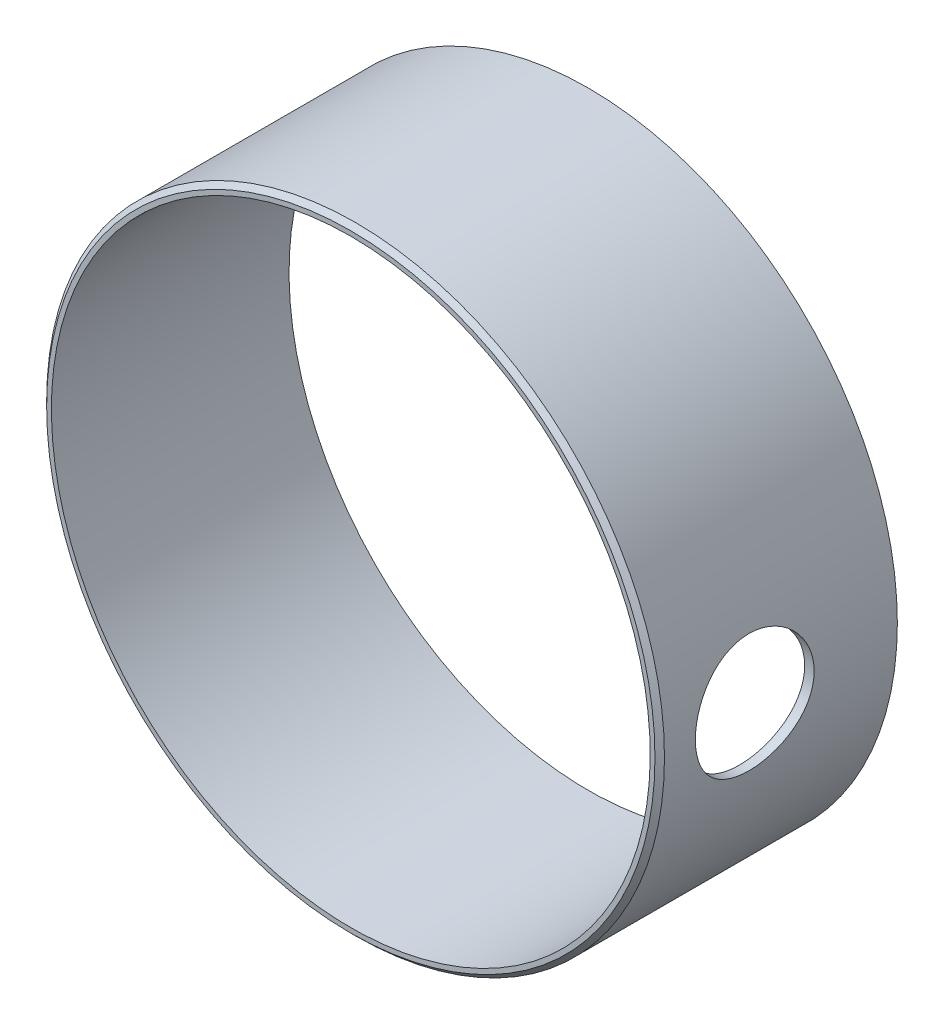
ISO-10303-21;
HEADER;
FILE_DESCRIPTION(('STEP AP214'),'2;1');
FILE_NAME('part.step','',(''),(''),'','','');
FILE_SCHEMA(('AUTOMOTIVE_DESIGN { 1 0 10303 214 1 1 1 1 }'));
ENDSEC;
DATA;
#1=APPLICATION_CONTEXT('core data for automotive mechanical design processes');
#2=APPLICATION_PROTOCOL_DEFINITION('international standard','automotive_design',2000,#1);
#3=PRODUCT_CONTEXT('',#1,'mechanical');
#4=PRODUCT('Part','Part','',(#3));
#5=PRODUCT_RELATED_PRODUCT_CATEGORY('part','',(#4));
#6=PRODUCT_DEFINITION_FORMATION('','',#4);
#7=PRODUCT_DEFINITION_CONTEXT('part definition',#1,'design');
#8=PRODUCT_DEFINITION('design','',#6,#7);
#9=PRODUCT_DEFINITION_SHAPE('','',#8);
#10=(LENGTH_UNIT() NAMED_UNIT(*) SI_UNIT(.MILLI.,.METRE.));
#11=(NAMED_UNIT(*) PLANE_ANGLE_UNIT() SI_UNIT($,.RADIAN.));
#12=(NAMED_UNIT(*) SI_UNIT($,.STERADIAN.) SOLID_ANGLE_UNIT());
#13=UNCERTAINTY_MEASURE_WITH_UNIT(LENGTH_MEASURE(1.E-05),#10,'distance_accuracy_value','');
#14=(GEOMETRIC_REPRESENTATION_CONTEXT(3) GLOBAL_UNCERTAINTY_ASSIGNED_CONTEXT((#13)) GLOBAL_UNIT_ASSIGNED_CONTEXT((#10,
#11,#12)) REPRESENTATION_CONTEXT('',''));
#15=CARTESIAN_POINT('',(0.,0.,0.));
#16=DIRECTION('',(0.,0.,1.));
#17=DIRECTION('',(1.,0.,0.));
#18=AXIS2_PLACEMENT_3D('',#15,#16,#17);
#19=CARTESIAN_POINT('',(0.,0.,0.));
#20=DIRECTION('',(0.,0.,-1.));
#21=DIRECTION('',(0.,1.,0.));
#22=AXIS2_PLACEMENT_3D('',#19,#20,#21);
#23=CYLINDRICAL_SURFACE('',#22,31.5);
#24=CARTESIAN_POINT('',(30.8737347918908,6.25,15.));
#25=CARTESIAN_POINT('',(30.8737329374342,6.25000343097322,14.8262727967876));
#26=CARTESIAN_POINT('',(30.8752038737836,6.24275461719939,14.6525886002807));
#27=CARTESIAN_POINT('',(30.8810399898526,6.21382371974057,14.3064233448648));
#28=CARTESIAN_POINT('',(30.8854056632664,6.19213917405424,14.133942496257));
#29=CARTESIAN_POINT('',(30.8969076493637,6.13448898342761,13.7913916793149));
#30=CARTESIAN_POINT('',(30.9040454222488,6.09851581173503,13.621323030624));
#31=CARTESIAN_POINT('',(30.920884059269,6.01255741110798,13.2848273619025));
#32=CARTESIAN_POINT('',(30.9305858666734,5.96256702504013,13.1184017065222));
#33=CARTESIAN_POINT('',(30.9522540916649,5.84904246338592,12.7906471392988));
#34=CARTESIAN_POINT('',(30.9642173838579,5.78552696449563,12.6293115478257));
#35=CARTESIAN_POINT('',(30.9900789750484,5.64535938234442,12.3125428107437));
#36=CARTESIAN_POINT('',(31.0039779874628,5.56870245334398,12.1571118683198));
#37=CARTESIAN_POINT('',(31.0333077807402,5.40285962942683,11.8533284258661));
#38=CARTESIAN_POINT('',(31.0487378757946,5.31367933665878,11.7049728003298));
#39=CARTESIAN_POINT('',(31.0807103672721,5.12335381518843,11.4161945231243));
#40=CARTESIAN_POINT('',(31.0972531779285,5.02220411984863,11.2757748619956));
#41=CARTESIAN_POINT('',(31.1311941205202,4.80736089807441,11.0022010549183));
#42=CARTESIAN_POINT('',(31.1486001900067,4.69353017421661,10.8691556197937));
#43=CARTESIAN_POINT('',(31.1835977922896,4.45508145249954,10.6130450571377));
#44=CARTESIAN_POINT('',(31.2011893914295,4.33045947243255,10.4899836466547));
#45=CARTESIAN_POINT('',(31.2360566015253,4.07134467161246,10.2547644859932));
#46=CARTESIAN_POINT('',(31.2533323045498,3.93685478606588,10.1426035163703));
#47=CARTESIAN_POINT('',(31.287099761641,3.65882536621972,9.92987700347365));
#48=CARTESIAN_POINT('',(31.3035912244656,3.5152825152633,9.82931574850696));
#49=CARTESIAN_POINT('',(31.3354557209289,3.21894343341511,9.63976772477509));
#50=CARTESIAN_POINT('',(31.35081843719,3.06608079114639,9.55088298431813));
#51=CARTESIAN_POINT('',(31.3798443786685,2.75319259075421,9.3862938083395));
#52=CARTESIAN_POINT('',(31.3935069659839,2.59316437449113,9.31059431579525));
#53=CARTESIAN_POINT('',(31.4187299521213,2.26717444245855,9.17302141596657));
#54=CARTESIAN_POINT('',(31.4302912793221,2.10121538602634,9.11114189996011));
#55=CARTESIAN_POINT('',(31.4509947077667,1.7645151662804,9.00163271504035));
#56=CARTESIAN_POINT('',(31.4601359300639,1.59377229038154,8.95400822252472));
#57=CARTESIAN_POINT('',(31.4832888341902,1.08068516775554,8.83425214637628));
#58=CARTESIAN_POINT('',(31.4933997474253,0.732839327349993,8.78328595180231));
#59=CARTESIAN_POINT('',(31.4997983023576,0.208828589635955,8.75102221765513));
#60=CARTESIAN_POINT('',(31.5004683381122,0.0337130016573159,8.74763952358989));
#61=CARTESIAN_POINT('',(31.4988983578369,-0.316194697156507,8.75555272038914));
#62=CARTESIAN_POINT('',(31.4966582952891,-0.490986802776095,8.76684884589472));
#63=CARTESIAN_POINT('',(31.4857296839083,-1.00796703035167,8.82219674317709));
#64=CARTESIAN_POINT('',(31.472893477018,-1.34804279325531,8.88739452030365));
#65=CARTESIAN_POINT('',(31.4374323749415,-2.01215083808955,9.07270935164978));
#66=CARTESIAN_POINT('',(31.4148070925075,-2.33618248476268,9.19282857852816));
#67=CARTESIAN_POINT('',(31.3620508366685,-2.96156349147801,9.48533891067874));
#68=CARTESIAN_POINT('',(31.3318740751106,-3.26275931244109,9.65805034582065));
#69=CARTESIAN_POINT('',(31.267341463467,-3.83218353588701,10.0506044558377));
#70=CARTESIAN_POINT('',(31.2329851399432,-4.10040819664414,10.2704524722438));
#71=CARTESIAN_POINT('',(31.1631945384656,-4.60113096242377,10.7555155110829));
#72=CARTESIAN_POINT('',(31.1277518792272,-4.83293716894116,11.0214441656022));
#73=CARTESIAN_POINT('',(31.060342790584,-5.24877307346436,11.5887575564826));
#74=CARTESIAN_POINT('',(31.0283764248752,-5.43280189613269,11.8901429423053));
#75=CARTESIAN_POINT('',(30.9715233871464,-5.74809359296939,12.5207984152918));
#76=CARTESIAN_POINT('',(30.9466515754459,-5.87924594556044,12.8501251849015));
#77=CARTESIAN_POINT('',(30.9070229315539,-6.08415448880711,13.5267477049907));
#78=CARTESIAN_POINT('',(30.8922648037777,-6.15791803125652,13.8740411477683));
#79=CARTESIAN_POINT('',(30.8747936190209,-6.24492412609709,14.5704712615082));
#80=CARTESIAN_POINT('',(30.8718818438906,-6.25916525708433,14.9194783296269));
#81=CARTESIAN_POINT('',(30.8778998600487,-6.22940790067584,15.6148815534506));
#82=CARTESIAN_POINT('',(30.8868289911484,-6.1854126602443,15.9612778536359));
#83=CARTESIAN_POINT('',(30.9153367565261,-6.0412921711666,16.6382796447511));
#84=CARTESIAN_POINT('',(30.9348143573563,-5.94169916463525,16.9690030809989));
#85=CARTESIAN_POINT('',(30.9821360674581,-5.68977753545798,17.6090696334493));
#86=CARTESIAN_POINT('',(31.0099808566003,-5.53744462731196,17.9184110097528));
#87=CARTESIAN_POINT('',(31.0713466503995,-5.18210654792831,18.511304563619));
#88=CARTESIAN_POINT('',(31.1049359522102,-4.97847581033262,18.7944745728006));
#89=CARTESIAN_POINT('',(31.1738185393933,-4.52714037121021,19.3229918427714));
#90=CARTESIAN_POINT('',(31.2091119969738,-4.27943120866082,19.5683352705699));
#91=CARTESIAN_POINT('',(31.2780686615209,-3.74255534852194,20.0179967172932));
#92=CARTESIAN_POINT('',(31.3116992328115,-3.45281947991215,20.2216398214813));
#93=CARTESIAN_POINT('',(31.3729823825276,-2.84247168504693,20.5774022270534));
#94=CARTESIAN_POINT('',(31.4006352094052,-2.52186104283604,20.7295236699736));
#95=CARTESIAN_POINT('',(31.4352174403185,-2.02598824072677,20.9151464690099));
#96=CARTESIAN_POINT('',(31.4455792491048,-1.85860970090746,20.9698495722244));
#97=CARTESIAN_POINT('',(31.463775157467,-1.51972246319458,21.0649695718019));
#98=CARTESIAN_POINT('',(31.471610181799,-1.34821530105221,21.1053916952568));
#99=CARTESIAN_POINT('',(31.4845261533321,-1.00229480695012,21.1716235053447));
#100=CARTESIAN_POINT('',(31.4896068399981,-0.827881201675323,21.1974318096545));
#101=CARTESIAN_POINT('',(31.4968690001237,-0.4774391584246,21.2342269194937));
#102=CARTESIAN_POINT('',(31.4990505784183,-0.301410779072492,21.2452142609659));
#103=CARTESIAN_POINT('',(31.500439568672,0.0479346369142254,21.2522158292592));
#104=CARTESIAN_POINT('',(31.4996972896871,0.221246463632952,21.2484833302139));
#105=CARTESIAN_POINT('',(31.4953722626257,0.566923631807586,21.2266434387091));
#106=CARTESIAN_POINT('',(31.4917895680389,0.739288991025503,21.2085363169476));
#107=CARTESIAN_POINT('',(31.4818824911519,1.08187200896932,21.1580870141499));
#108=CARTESIAN_POINT('',(31.4755576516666,1.2520893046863,21.1257424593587));
#109=CARTESIAN_POINT('',(31.4603441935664,1.5890828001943,21.0470855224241));
#110=CARTESIAN_POINT('',(31.4514564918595,1.75586020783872,21.0007781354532));
#111=CARTESIAN_POINT('',(31.4313799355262,2.08456723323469,20.8946460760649));
#112=CARTESIAN_POINT('',(31.4201954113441,2.24650532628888,20.8348468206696));
#113=CARTESIAN_POINT('',(31.3958242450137,2.56469769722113,20.7021512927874));
#114=CARTESIAN_POINT('',(31.3826383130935,2.72095396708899,20.6292596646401));
#115=CARTESIAN_POINT('',(31.3546124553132,3.02686005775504,20.4708589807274));
#116=CARTESIAN_POINT('',(31.339771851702,3.17650713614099,20.3853447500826));
#117=CARTESIAN_POINT('',(31.3088462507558,3.4680884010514,20.2023533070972));
#118=CARTESIAN_POINT('',(31.2927616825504,3.61002521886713,20.1048802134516));
#119=CARTESIAN_POINT('',(31.2595064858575,3.88755786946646,19.8969324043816));
#120=CARTESIAN_POINT('',(31.2423224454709,4.02301297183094,19.7862719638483));
#121=CARTESIAN_POINT('',(31.2075919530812,4.28410395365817,19.5540603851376));
#122=CARTESIAN_POINT('',(31.1900456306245,4.40974326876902,19.4325130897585));
#123=CARTESIAN_POINT('',(31.1550607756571,4.6504833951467,19.1792400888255));
#124=CARTESIAN_POINT('',(31.1376223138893,4.76557785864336,19.0475083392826));
#125=CARTESIAN_POINT('',(31.1033572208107,4.98431786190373,18.7748655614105));
#126=CARTESIAN_POINT('',(31.0865303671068,5.08796759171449,18.6339579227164));
#127=CARTESIAN_POINT('',(31.0537767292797,5.28421806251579,18.3422708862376));
#128=CARTESIAN_POINT('',(31.0378618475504,5.37668508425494,18.1914001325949));
#129=CARTESIAN_POINT('',(31.0076039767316,5.54852295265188,17.8822996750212));
#130=CARTESIAN_POINT('',(30.993260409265,5.62789862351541,17.7240727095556));
#131=CARTESIAN_POINT('',(30.9665697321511,5.77295436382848,17.4014078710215));
#132=CARTESIAN_POINT('',(30.9542213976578,5.83864284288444,17.2369738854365));
#133=CARTESIAN_POINT('',(30.9318811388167,5.95586065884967,16.9030366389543));
#134=CARTESIAN_POINT('',(30.9218887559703,6.00739275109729,16.7335343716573));
#135=CARTESIAN_POINT('',(30.9003663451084,6.11734689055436,16.3075185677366));
#136=CARTESIAN_POINT('',(30.890434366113,6.16702408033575,16.0486126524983));
#137=CARTESIAN_POINT('',(30.877120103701,6.23334748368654,15.526438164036));
#138=CARTESIAN_POINT('',(30.8737376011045,6.24999480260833,15.2631697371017));
#139=CARTESIAN_POINT('',(30.8737347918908,6.25,15.));
#140=B_SPLINE_CURVE_WITH_KNOTS('',3,(#24,#25,#26,#27,#28,#29,#30,#31,#32,#33,#34,#35,#36,#37,
#38,#39,#40,#41,#42,#43,#44,#45,#46,#47,#48,#49,#50,#51,#52,#53,#54,#55,#56,#57,#58,#59,#60,#61,
#62,#63,#64,#65,#66,#67,#68,#69,#70,#71,#72,#73,#74,#75,#76,#77,#78,#79,#80,#81,#82,#83,#84,#85,
#86,#87,#88,#89,#90,#91,#92,#93,#94,#95,#96,#97,#98,#99,#100,#101,#102,#103,#104,#105,#106,#107,
#108,#109,#110,#111,#112,#113,#114,#115,#116,#117,#118,#119,#120,#121,#122,#123,#124,#125,#126,
#127,#128,#129,#130,#131,#132,#133,#134,#135,#136,#137,#138,#139),.UNSPECIFIED.,.T.,.F.,(4,2,2,
2,2,2,2,2,2,2,2,2,2,2,2,2,2,2,2,2,2,2,2,2,2,2,2,2,2,2,2,2,2,2,2,2,2,2,2,2,2,2,2,2,2,2,2,2,2,2,2,
2,2,2,2,2,2,4),(0.,0.520950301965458,1.04198947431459,1.56330347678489,2.08480953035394,
2.60560005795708,3.12658303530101,3.64733369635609,4.16827930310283,4.69554003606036,
5.22299617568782,5.75029605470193,6.27779025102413,6.80962408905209,7.34165687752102,
7.87345402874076,8.40544405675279,9.45446135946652,9.97939718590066,10.5043414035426,
11.5385567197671,12.5728129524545,13.6134991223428,14.6543032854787,15.7129641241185,
16.7716443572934,17.8325260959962,18.8932719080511,19.9361488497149,20.978967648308,
22.0119705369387,23.0450573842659,24.0914101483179,25.137868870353,26.2001181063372,
27.2623231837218,27.7909802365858,28.3194435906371,28.8479569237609,29.3764511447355,
29.8958919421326,30.4153229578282,30.9348406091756,31.4541726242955,31.9725343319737,
32.4907125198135,33.0091037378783,33.5273169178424,34.0539609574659,34.5804198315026,
35.107193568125,35.6337738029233,36.1661321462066,36.698293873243,37.2301276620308,
37.7618578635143,38.551043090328,39.3402019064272),.UNSPECIFIED.);
#141=CARTESIAN_POINT('',(30.8737347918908,6.25,15.));
#142=VERTEX_POINT('',#141);
#143=EDGE_CURVE('E48',#142,#142,#140,.T.);
#144=ORIENTED_EDGE('',*,*,#143,.F.);
#145=EDGE_LOOP('',(#144));
#146=FACE_BOUND('',#145,.T.);
#147=CARTESIAN_POINT('',(0.,0.,0.));
#148=DIRECTION('',(0.,0.,-1.));
#149=DIRECTION('',(0.,1.,0.));
#150=AXIS2_PLACEMENT_3D('',#147,#148,#149);
#151=CIRCLE('',#150,31.5);
#152=CARTESIAN_POINT('',(0.,31.5,0.));
#153=VERTEX_POINT('',#152);
#154=EDGE_CURVE('E54',#153,#153,#151,.T.);
#155=ORIENTED_EDGE('',*,*,#154,.T.);
#156=EDGE_LOOP('',(#155));
#157=FACE_BOUND('',#156,.T.);
#158=CARTESIAN_POINT('',(0.,0.,25.));
#159=DIRECTION('',(0.,0.,-1.));
#160=DIRECTION('',(0.,1.,0.));
#161=AXIS2_PLACEMENT_3D('',#158,#159,#160);
#162=CIRCLE('',#161,31.5);
#163=CARTESIAN_POINT('',(0.,31.5,25.));
#164=VERTEX_POINT('',#163);
#165=EDGE_CURVE('E27',#164,#164,#162,.T.);
#166=ORIENTED_EDGE('',*,*,#165,.F.);
#167=EDGE_LOOP('',(#166));
#168=FACE_BOUND('',#167,.T.);
#169=ADVANCED_FACE('F12',(#146,#157,#168),#23,.F.);
#170=CARTESIAN_POINT('',(31.5,0.,25.));
#171=DIRECTION('',(0.,0.,1.));
#172=DIRECTION('',(0.,-1.,0.));
#173=AXIS2_PLACEMENT_3D('',#170,#171,#172);
#174=PLANE('',#173);
#175=CARTESIAN_POINT('',(0.,0.,25.));
#176=DIRECTION('',(0.,0.,1.));
#177=DIRECTION('',(0.,-1.,0.));
#178=AXIS2_PLACEMENT_3D('',#175,#176,#177);
#179=CIRCLE('',#178,32.);
#180=CARTESIAN_POINT('',(0.,-32.,25.));
#181=VERTEX_POINT('',#180);
#182=EDGE_CURVE('E8',#181,#181,#179,.T.);
#183=ORIENTED_EDGE('',*,*,#182,.T.);
#184=EDGE_LOOP('',(#183));
#185=FACE_BOUND('',#184,.T.);
#186=ORIENTED_EDGE('',*,*,#165,.T.);
#187=EDGE_LOOP('',(#186));
#188=FACE_BOUND('',#187,.T.);
#189=ADVANCED_FACE('F63',(#185,#188),#174,.T.);
#190=CARTESIAN_POINT('',(0.,0.,0.));
#191=DIRECTION('',(0.,0.,-1.));
#192=DIRECTION('',(0.,1.,0.));
#193=AXIS2_PLACEMENT_3D('',#190,#191,#192);
#194=CYLINDRICAL_SURFACE('',#193,32.5);
#195=CARTESIAN_POINT('',(0.,0.,24.5));
#196=DIRECTION('',(0.,0.,1.));
#197=DIRECTION('',(0.,-1.,0.));
#198=AXIS2_PLACEMENT_3D('',#195,#196,#197);
#199=CIRCLE('',#198,32.5);
#200=CARTESIAN_POINT('',(0.,-32.5,24.5));
#201=VERTEX_POINT('',#200);
#202=EDGE_CURVE('E19',#201,#201,#199,.F.);
#203=ORIENTED_EDGE('',*,*,#202,.T.);
#204=EDGE_LOOP('',(#203));
#205=FACE_BOUND('',#204,.T.);
#206=CARTESIAN_POINT('',(31.8933770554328,6.25,15.));
#207=CARTESIAN_POINT('',(31.8933753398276,6.25000327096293,15.1738410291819));
#208=CARTESIAN_POINT('',(31.8948010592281,6.24274504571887,15.3476404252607));
#209=CARTESIAN_POINT('',(31.9004581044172,6.21377566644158,15.6940369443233));
#210=CARTESIAN_POINT('',(31.9046899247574,6.19206196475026,15.8666338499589));
#211=CARTESIAN_POINT('',(31.9158397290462,6.13433226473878,16.2094213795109));
#212=CARTESIAN_POINT('',(31.922759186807,6.09830841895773,16.379610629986));
#213=CARTESIAN_POINT('',(31.9390835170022,6.01222610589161,16.7163469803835));
#214=CARTESIAN_POINT('',(31.9484893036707,5.96216247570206,16.8828927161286));
#215=CARTESIAN_POINT('',(31.9694976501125,5.84846594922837,17.2108899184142));
#216=CARTESIAN_POINT('',(31.9810972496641,5.78485132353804,17.3723479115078));
#217=CARTESIAN_POINT('',(32.006173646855,5.64446025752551,17.6893550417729));
#218=CARTESIAN_POINT('',(32.0196511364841,5.56767896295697,17.8449019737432));
#219=CARTESIAN_POINT('',(32.0480920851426,5.40156342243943,18.1489049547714));
#220=CARTESIAN_POINT('',(32.0630548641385,5.31223491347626,18.2973642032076));
#221=CARTESIAN_POINT('',(32.0940593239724,5.12158984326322,18.5863339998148));
#222=CARTESIAN_POINT('',(32.1101014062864,5.02026881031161,18.7268415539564));
#223=CARTESIAN_POINT('',(32.1430021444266,4.80514138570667,19.0004683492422));
#224=CARTESIAN_POINT('',(32.1598680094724,4.69120616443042,19.1334854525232));
#225=CARTESIAN_POINT('',(32.1937781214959,4.4525474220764,19.3895287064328));
#226=CARTESIAN_POINT('',(32.2108224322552,4.32781991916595,19.5125511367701));
#227=CARTESIAN_POINT('',(32.2446029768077,4.06849685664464,19.747679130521));
#228=CARTESIAN_POINT('',(32.2613393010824,3.93390425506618,19.8597879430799));
#229=CARTESIAN_POINT('',(32.2940499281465,3.6556755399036,20.0723960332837));
#230=CARTESIAN_POINT('',(32.3100239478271,3.51203611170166,20.1728910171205));
#231=CARTESIAN_POINT('',(32.3408770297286,3.21559378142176,20.3622405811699));
#232=CARTESIAN_POINT('',(32.3557467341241,3.06272894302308,20.4509997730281));
#233=CARTESIAN_POINT('',(32.383838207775,2.74985581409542,20.6153392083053));
#234=CARTESIAN_POINT('',(32.3970593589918,2.58984487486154,20.6909145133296));
#235=CARTESIAN_POINT('',(32.4214643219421,2.26391530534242,20.828243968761));
#236=CARTESIAN_POINT('',(32.4326490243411,2.09799929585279,20.8900041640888));
#237=CARTESIAN_POINT('',(32.4526739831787,1.7613864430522,20.9992826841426));
#238=CARTESIAN_POINT('',(32.4615133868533,1.59068788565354,21.0467958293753));
#239=CARTESIAN_POINT('',(32.4839091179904,1.07760130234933,21.1663001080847));
#240=CARTESIAN_POINT('',(32.4936814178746,0.729829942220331,21.2170986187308));
#241=CARTESIAN_POINT('',(32.5018684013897,0.0307643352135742,21.2597397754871));
#242=CARTESIAN_POINT('',(32.5002841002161,-0.320529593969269,21.2515876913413));
#243=CARTESIAN_POINT('',(32.4860555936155,-1.01201493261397,21.177183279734));
#244=CARTESIAN_POINT('',(32.4735573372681,-1.35229163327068,21.1116976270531));
#245=CARTESIAN_POINT('',(32.4390639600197,-2.01692138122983,20.9256776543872));
#246=CARTESIAN_POINT('',(32.4170684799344,-2.34127382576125,20.8051412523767));
#247=CARTESIAN_POINT('',(32.3658107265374,-2.96707490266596,20.5117239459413));
#248=CARTESIAN_POINT('',(32.3365063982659,-3.26837731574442,20.3385387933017));
#249=CARTESIAN_POINT('',(32.2738674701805,-3.83792894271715,19.944963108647));
#250=CARTESIAN_POINT('',(32.2405324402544,-4.10617462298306,19.724567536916));
#251=CARTESIAN_POINT('',(32.1728863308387,-4.60654609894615,19.2386087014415));
#252=CARTESIAN_POINT('',(32.1385681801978,-4.83801970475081,18.9723744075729));
#253=CARTESIAN_POINT('',(32.0733360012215,-5.25313292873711,18.4045245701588));
#254=CARTESIAN_POINT('',(32.0424220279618,-5.43677177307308,18.1029084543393));
#255=CARTESIAN_POINT('',(31.9874867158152,-5.75120332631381,17.4719649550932));
#256=CARTESIAN_POINT('',(31.9634782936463,-5.8818971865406,17.1425871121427));
#257=CARTESIAN_POINT('',(31.9252669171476,-6.08590275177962,16.4659811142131));
#258=CARTESIAN_POINT('',(31.9110627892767,-6.1592213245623,16.118755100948));
#259=CARTESIAN_POINT('',(31.8943015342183,-6.24543438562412,15.4222016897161));
#260=CARTESIAN_POINT('',(31.8915634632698,-6.25926769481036,15.0729947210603));
#261=CARTESIAN_POINT('',(31.8975595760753,-6.22863772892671,14.3772615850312));
#262=CARTESIAN_POINT('',(31.9062931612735,-6.18417749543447,14.0307352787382));
#263=CARTESIAN_POINT('',(31.9340796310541,-6.03903008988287,13.353312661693));
#264=CARTESIAN_POINT('',(31.9530414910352,-5.93883864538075,13.0223060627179));
#265=CARTESIAN_POINT('',(31.9990690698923,-5.68559918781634,12.3817778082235));
#266=CARTESIAN_POINT('',(32.026135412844,-5.5325471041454,12.0722578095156));
#267=CARTESIAN_POINT('',(32.0857321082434,-5.17578819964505,11.4793646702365));
#268=CARTESIAN_POINT('',(32.118324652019,-4.97149047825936,11.1963535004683));
#269=CARTESIAN_POINT('',(32.1851285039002,-4.5188157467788,10.6682861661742));
#270=CARTESIAN_POINT('',(32.2193399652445,-4.2704345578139,10.4232336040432));
#271=CARTESIAN_POINT('',(32.2861089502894,-3.73250697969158,9.97452954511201));
#272=CARTESIAN_POINT('',(32.3186363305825,-3.44242926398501,9.77151091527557));
#273=CARTESIAN_POINT('',(32.3778649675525,-2.83154235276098,9.41704698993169));
#274=CARTESIAN_POINT('',(32.4045664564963,-2.51073438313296,9.26559963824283));
#275=CARTESIAN_POINT('',(32.4379215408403,-2.01464488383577,9.08098109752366));
#276=CARTESIAN_POINT('',(32.4479090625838,-1.8471861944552,9.02660678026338));
#277=CARTESIAN_POINT('',(32.4654296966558,-1.50817536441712,8.93214956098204));
#278=CARTESIAN_POINT('',(32.472963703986,-1.33662474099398,8.89206144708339));
#279=CARTESIAN_POINT('',(32.4853597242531,-0.990652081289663,8.82649797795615));
#280=CARTESIAN_POINT('',(32.4902214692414,-0.816229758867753,8.80102408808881));
#281=CARTESIAN_POINT('',(32.4971341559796,-0.465803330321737,8.76489407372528));
#282=CARTESIAN_POINT('',(32.49918519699,-0.289799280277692,8.75423742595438));
#283=CARTESIAN_POINT('',(32.500407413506,0.059650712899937,8.74788116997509));
#284=CARTESIAN_POINT('',(32.499624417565,0.233092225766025,8.75194354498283));
#285=CARTESIAN_POINT('',(32.495302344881,0.579000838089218,8.77446415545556));
#286=CARTESIAN_POINT('',(32.4917633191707,0.751467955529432,8.79292212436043));
#287=CARTESIAN_POINT('',(32.4820268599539,1.09422697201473,8.84409238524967));
#288=CARTESIAN_POINT('',(32.4758289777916,1.26451849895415,8.87680708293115));
#289=CARTESIAN_POINT('',(32.460949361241,1.60163204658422,8.95622200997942));
#290=CARTESIAN_POINT('',(32.4522685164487,1.76845528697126,9.00291723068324));
#291=CARTESIAN_POINT('',(32.4326773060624,2.09726659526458,9.10985456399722));
#292=CARTESIAN_POINT('',(32.4217705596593,2.2592620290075,9.17007470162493));
#293=CARTESIAN_POINT('',(32.3980211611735,2.5775345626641,9.30363366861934));
#294=CARTESIAN_POINT('',(32.3851791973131,2.73381367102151,9.37696783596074));
#295=CARTESIAN_POINT('',(32.3578994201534,3.03972693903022,9.53627299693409));
#296=CARTESIAN_POINT('',(32.3434609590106,3.18935836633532,9.62224912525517));
#297=CARTESIAN_POINT('',(32.3133879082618,3.48086610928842,9.8061802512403));
#298=CARTESIAN_POINT('',(32.2977537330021,3.6227450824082,9.90413110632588));
#299=CARTESIAN_POINT('',(32.2654590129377,3.89999142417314,10.1129613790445));
#300=CARTESIAN_POINT('',(32.2487863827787,4.0352251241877,10.2240164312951));
#301=CARTESIAN_POINT('',(32.2151056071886,4.29583900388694,10.4570045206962));
#302=CARTESIAN_POINT('',(32.1980975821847,4.42122264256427,10.5789337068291));
#303=CARTESIAN_POINT('',(32.1642026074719,4.66141542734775,10.8329532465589));
#304=CARTESIAN_POINT('',(32.1473157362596,4.77621820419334,10.96504963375));
#305=CARTESIAN_POINT('',(32.1141519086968,4.9943383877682,11.2383983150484));
#306=CARTESIAN_POINT('',(32.0978747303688,5.09766000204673,11.3796472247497));
#307=CARTESIAN_POINT('',(32.0662215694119,5.29314108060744,11.6718812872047));
#308=CARTESIAN_POINT('',(32.0508564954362,5.38517569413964,11.8229511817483));
#309=CARTESIAN_POINT('',(32.0216628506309,5.55613431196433,12.1324036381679));
#310=CARTESIAN_POINT('',(32.0078337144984,5.63506314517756,12.2907834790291));
#311=CARTESIAN_POINT('',(31.9821207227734,5.7792143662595,12.6137019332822));
#312=CARTESIAN_POINT('',(31.9702356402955,5.84444540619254,12.7782365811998));
#313=CARTESIAN_POINT('',(31.9487559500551,5.96074472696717,13.1123247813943));
#314=CARTESIAN_POINT('',(31.939160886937,6.01181582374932,13.2818773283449));
#315=CARTESIAN_POINT('',(31.9186445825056,6.12000910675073,13.7055305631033));
#316=CARTESIAN_POINT('',(31.909220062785,6.1686911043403,13.9619100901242));
#317=CARTESIAN_POINT('',(31.8965876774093,6.23368361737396,14.4788909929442));
#318=CARTESIAN_POINT('',(31.893379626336,6.24999509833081,14.7394922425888));
#319=CARTESIAN_POINT('',(31.8933770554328,6.25,15.));
#320=B_SPLINE_CURVE_WITH_KNOTS('',3,(#206,#207,#208,#209,#210,#211,#212,#213,#214,#215,#216,
#217,#218,#219,#220,#221,#222,#223,#224,#225,#226,#227,#228,#229,#230,#231,#232,#233,#234,#235,
#236,#237,#238,#239,#240,#241,#242,#243,#244,#245,#246,#247,#248,#249,#250,#251,#252,#253,#254,
#255,#256,#257,#258,#259,#260,#261,#262,#263,#264,#265,#266,#267,#268,#269,#270,#271,#272,#273,
#274,#275,#276,#277,#278,#279,#280,#281,#282,#283,#284,#285,#286,#287,#288,#289,#290,#291,#292,
#293,#294,#295,#296,#297,#298,#299,#300,#301,#302,#303,#304,#305,#306,#307,#308,#309,#310,#311,
#312,#313,#314,#315,#316,#317,#318,#319),.UNSPECIFIED.,.T.,.F.,(4,2,2,2,2,2,2,2,2,2,2,2,2,2,2,2,
2,2,2,2,2,2,2,2,2,2,2,2,2,2,2,2,2,2,2,2,2,2,2,2,2,2,2,2,2,2,2,2,2,2,2,2,2,2,2,2,4),(0.,
0.521294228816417,1.04268035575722,1.56435279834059,2.08621732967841,2.6073826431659,
3.12874051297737,3.64986077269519,4.17117596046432,4.69841694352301,5.22585328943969,
5.75313212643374,6.28060528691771,6.81213194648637,7.34385727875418,7.87534949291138,
8.40703469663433,9.45626565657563,10.5054028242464,11.5407214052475,12.5760791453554,
13.6175375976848,14.659107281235,15.7174724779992,16.7758547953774,17.8362041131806,
18.8964264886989,19.9398531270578,20.9832253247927,22.0174618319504,23.051777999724,
24.0986179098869,25.1455571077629,26.207266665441,27.2689338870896,27.7974504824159,
28.3257740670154,28.8541506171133,29.3825085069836,29.902360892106,30.4222036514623,
30.9421341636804,31.4618786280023,31.9807846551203,32.4995065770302,33.0184397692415,
33.5371939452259,34.0639246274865,34.5904695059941,35.1173293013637,35.6439953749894,
36.1760432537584,36.7078946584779,37.2394091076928,37.770817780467,38.5520213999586,
39.3332017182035),.UNSPECIFIED.);
#321=CARTESIAN_POINT('',(31.8933770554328,6.25,15.));
#322=VERTEX_POINT('',#321);
#323=EDGE_CURVE('E23',#322,#322,#320,.T.);
#324=ORIENTED_EDGE('',*,*,#323,.F.);
#325=EDGE_LOOP('',(#324));
#326=FACE_BOUND('',#325,.T.);
#327=CARTESIAN_POINT('',(0.,0.,0.));
#328=DIRECTION('',(0.,0.,-1.));
#329=DIRECTION('',(0.,1.,0.));
#330=AXIS2_PLACEMENT_3D('',#327,#328,#329);
#331=CIRCLE('',#330,32.5);
#332=CARTESIAN_POINT('',(0.,32.5,0.));
#333=VERTEX_POINT('',#332);
#334=EDGE_CURVE('E56',#333,#333,#331,.T.);
#335=ORIENTED_EDGE('',*,*,#334,.F.);
#336=EDGE_LOOP('',(#335));
#337=FACE_BOUND('',#336,.T.);
#338=ADVANCED_FACE('F36',(#205,#326,#337),#194,.T.);
#339=CARTESIAN_POINT('',(31.5,0.,0.));
#340=DIRECTION('',(0.,0.,-1.));
#341=DIRECTION('',(0.,1.,0.));
#342=AXIS2_PLACEMENT_3D('',#339,#340,#341);
#343=PLANE('',#342);
#344=ORIENTED_EDGE('',*,*,#334,.T.);
#345=EDGE_LOOP('',(#344));
#346=FACE_BOUND('',#345,.T.);
#347=ORIENTED_EDGE('',*,*,#154,.F.);
#348=EDGE_LOOP('',(#347));
#349=FACE_BOUND('',#348,.T.);
#350=ADVANCED_FACE('F44',(#346,#349),#343,.T.);
#351=CARTESIAN_POINT('',(22.5,0.,15.));
#352=DIRECTION('',(1.,0.,0.));
#353=DIRECTION('',(0.,1.,0.));
#354=AXIS2_PLACEMENT_3D('',#351,#352,#353);
#355=CYLINDRICAL_SURFACE('',#354,6.25);
#356=ORIENTED_EDGE('',*,*,#143,.T.);
#357=EDGE_LOOP('',(#356));
#358=FACE_BOUND('',#357,.T.);
#359=ORIENTED_EDGE('',*,*,#323,.T.);
#360=EDGE_LOOP('',(#359));
#361=FACE_BOUND('',#360,.T.);
#362=ADVANCED_FACE('F39',(#358,#361),#355,.F.);
#363=CARTESIAN_POINT('',(0.,0.,24.5));
#364=DIRECTION('',(0.,0.,-1.));
#365=DIRECTION('',(0.,1.,0.));
#366=AXIS2_PLACEMENT_3D('',#363,#364,#365);
#367=CONICAL_SURFACE('',#366,32.5,0.785398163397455);
#368=ORIENTED_EDGE('',*,*,#182,.F.);
#369=EDGE_LOOP('',(#368));
#370=FACE_BOUND('',#369,.T.);
#371=ORIENTED_EDGE('',*,*,#202,.F.);
#372=EDGE_LOOP('',(#371));
#373=FACE_BOUND('',#372,.T.);
#374=ADVANCED_FACE('F43',(#370,#373),#367,.T.);
#375=CLOSED_SHELL('',(#169,#189,#338,#350,#362,#374));
#376=MANIFOLD_SOLID_BREP('B1',#375);
#377=ADVANCED_BREP_SHAPE_REPRESENTATION('',(#18,#376),#14);
#378=SHAPE_DEFINITION_REPRESENTATION(#9,#377);
ENDSEC;
END-ISO-10303-21;
